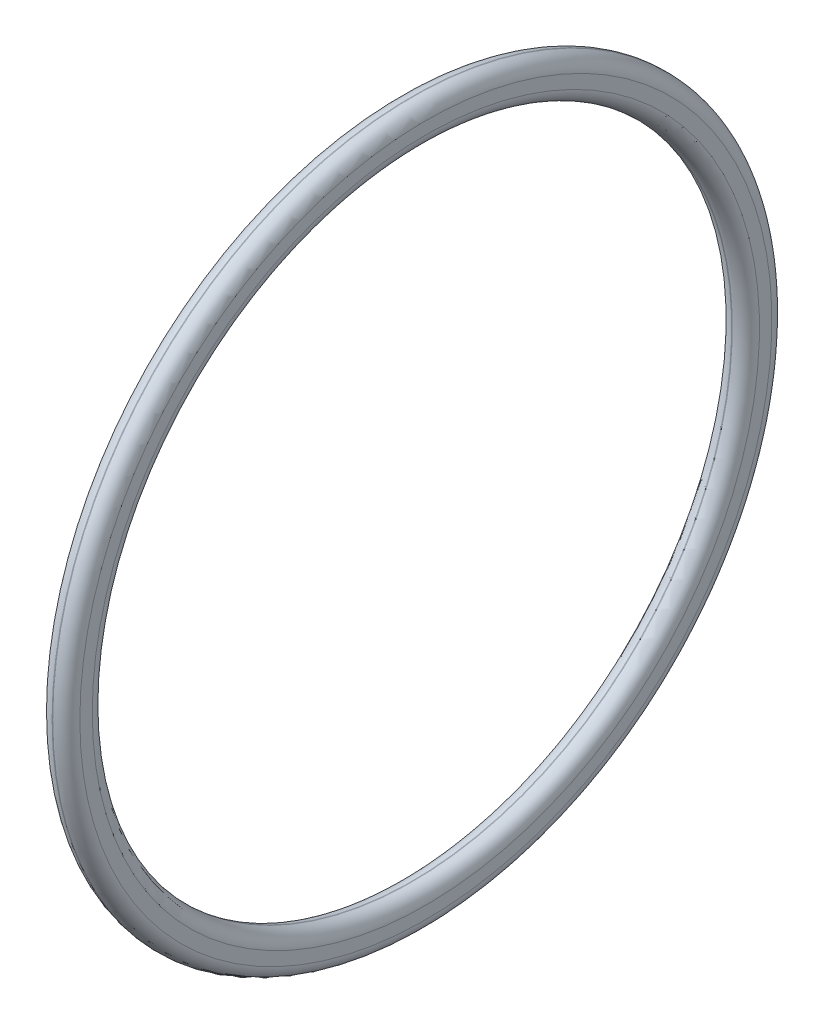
from build123d import *


with BuildPart() as part:
    # montassembl → R_volution1 (revolve)
    with BuildSketch(Plane.XY, mode=Mode.PRIVATE) as r_volution1_sk:
        with BuildLine():
            Line((1.100099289, 27.44641449), (1.100099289, 26.459773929))
            ThreePointArc((1.100099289, 26.459773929), (0.785209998, 25.699563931), (0.025, 25.38467464))
            Line((0.025, 25.38467464), (-0.025, 25.38467464))
            ThreePointArc((-0.025, 25.38467464), (-0.785209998, 25.699563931), (-1.100099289, 26.459773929))
            Line((-1.100099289, 26.459773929), (-1.100099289, 27.44641449))
            ThreePointArc((-1.100099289, 27.44641449), (-0.785209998, 28.206624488), (-0.025, 28.521513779))
            Line((-0.025, 28.521513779), (0.025, 28.521513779))
            ThreePointArc((0.025, 28.521513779), (0.785209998, 28.206624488), (1.100099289, 27.44641449))
        make_face()
    revolve(r_volution1_sk.sketch.rotate(Axis((0, 0, 0), (1, 0, 0)), 90), axis=Axis((0, 0, 0), (1, 0, 0)))


solid = part.part
